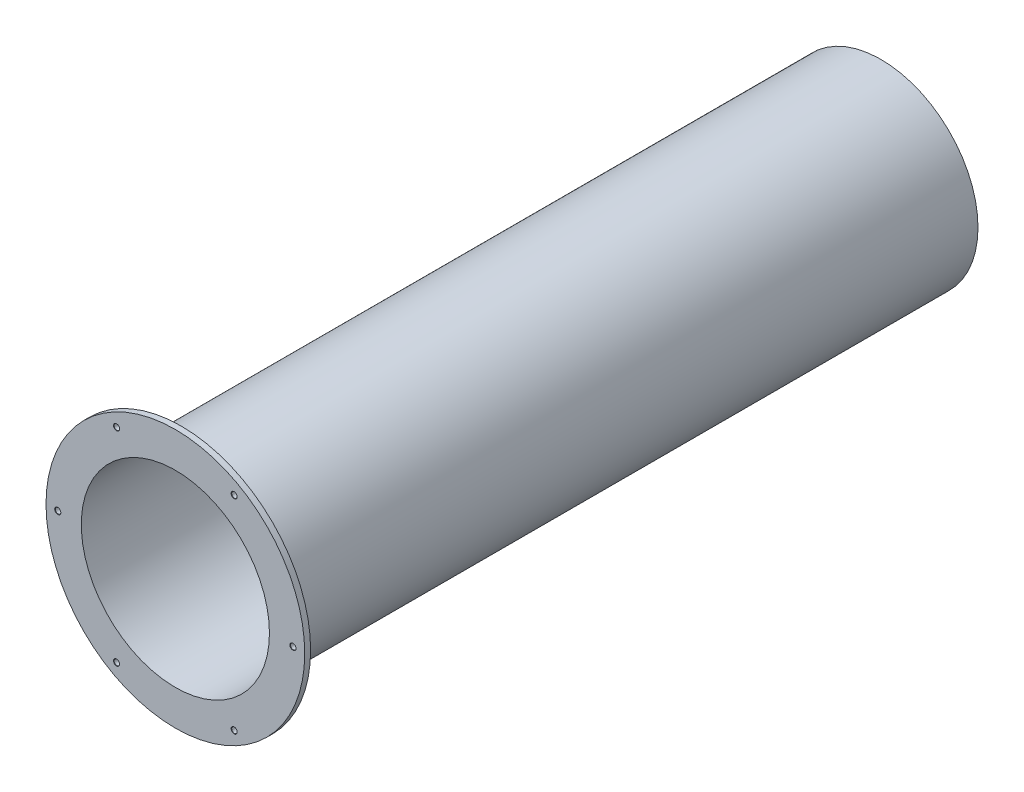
from build123d import *

# Parameters (mm, degrees)
SKETCH1_R                                 = 279.4
SKETCH1_R_2                               = 203.2
BOSS_EXTRUDE1_DEPTH                       = 12.7
BOSS_EXTRUDE2_START                       = -1524
SKETCH2_R                                 = 209.55
SKETCH2_R_2                               = 203.2
BOSS_EXTRUDE2_DEPTH                       = 1524
F_15_32_0_46875_DIAMETER_HOLE1_AT_2_COUNT = 2
F_15_32_0_46875_DIAMETER_HOLE1_AT_2_PITCH = 254
F_15_32_0_46875_DIAMETER_HOLE1_AT_3_COUNT = 2
F_15_32_0_46875_DIAMETER_HOLE1_AT_3_PITCH = 439.940905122
F_15_32_0_46875_DIAMETER_HOLE1_AT_4_COUNT = 2
F_15_32_0_46875_DIAMETER_HOLE1_AT_4_PITCH = 508
F_15_32_0_46875_DIAMETER_HOLE1_AT_5_COUNT = 2
F_15_32_0_46875_DIAMETER_HOLE1_AT_5_PITCH = 439.940905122
F_15_32_0_46875_DIAMETER_HOLE1_AT_6_COUNT = 2
F_15_32_0_46875_DIAMETER_HOLE1_AT_6_PITCH = 254


with BuildPart() as part:
    # Sketch1 → Boss-Extrude1 (new body)
    with BuildSketch(Plane.XY):
        Circle(SKETCH1_R)
        Circle(SKETCH1_R_2, mode=Mode.SUBTRACT)
    extrude(amount=BOSS_EXTRUDE1_DEPTH)

    # Sketch2 → Boss-Extrude2 (add)
    with BuildSketch(Plane.XY.offset(12.7).offset(BOSS_EXTRUDE2_START)):
        Circle(SKETCH2_R)
        Circle(SKETCH2_R_2, mode=Mode.SUBTRACT)
    extrude(amount=BOSS_EXTRUDE2_DEPTH)

    # Sketch4 → 15_32 _0.46875_ Diameter Hole1 (revolve, cut)
    with BuildSketch(Plane(origin=(254, 0, 12.7), x_dir=(0, -1, 0), z_dir=(1, 0, 0))):
        Polygon((0, 0), (0, 12.7), (6.588125, 12.7), (5.953125, 12.065), (5.953125, 0.635), (6.588125, 0), align=None)
    f_15_32_0_46875_diameter_hole1 = revolve(axis=Axis((254, 0, 19.05), (0, 0, -1)), mode=Mode.SUBTRACT)

    # 15_32 _0.46875_ Diameter Hole1 at 2: 15_32 _0.46875_ Diameter Hole1 ×2
    with Locations(*[Vector(-0.500000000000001, -0.8660254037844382, 0) * (i * F_15_32_0_46875_DIAMETER_HOLE1_AT_2_PITCH) for i in range(1, F_15_32_0_46875_DIAMETER_HOLE1_AT_2_COUNT)]):
        add(f_15_32_0_46875_diameter_hole1, mode=Mode.SUBTRACT)

    # 15_32 _0.46875_ Diameter Hole1 at 3: 15_32 _0.46875_ Diameter Hole1 ×2
    with Locations(*[Vector(-0.8660254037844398, -0.499999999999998, 0) * (i * F_15_32_0_46875_DIAMETER_HOLE1_AT_3_PITCH) for i in range(1, F_15_32_0_46875_DIAMETER_HOLE1_AT_3_COUNT)]):
        add(f_15_32_0_46875_diameter_hole1, mode=Mode.SUBTRACT)

    # 15_32 _0.46875_ Diameter Hole1 at 4: 15_32 _0.46875_ Diameter Hole1 ×2
    with Locations(*[(-i * F_15_32_0_46875_DIAMETER_HOLE1_AT_4_PITCH, 0, 0) for i in range(1, F_15_32_0_46875_DIAMETER_HOLE1_AT_4_COUNT)]):
        add(f_15_32_0_46875_diameter_hole1, mode=Mode.SUBTRACT)

    # 15_32 _0.46875_ Diameter Hole1 at 5: 15_32 _0.46875_ Diameter Hole1 ×2
    with Locations(*[Vector(-0.8660254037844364, 0.500000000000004, 0) * (i * F_15_32_0_46875_DIAMETER_HOLE1_AT_5_PITCH) for i in range(1, F_15_32_0_46875_DIAMETER_HOLE1_AT_5_COUNT)]):
        add(f_15_32_0_46875_diameter_hole1, mode=Mode.SUBTRACT)

    # 15_32 _0.46875_ Diameter Hole1 at 6: 15_32 _0.46875_ Diameter Hole1 ×2
    with Locations(*[Vector(-0.4999999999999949, 0.8660254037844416, 0) * (i * F_15_32_0_46875_DIAMETER_HOLE1_AT_6_PITCH) for i in range(1, F_15_32_0_46875_DIAMETER_HOLE1_AT_6_COUNT)]):
        add(f_15_32_0_46875_diameter_hole1, mode=Mode.SUBTRACT)


solid = part.part
